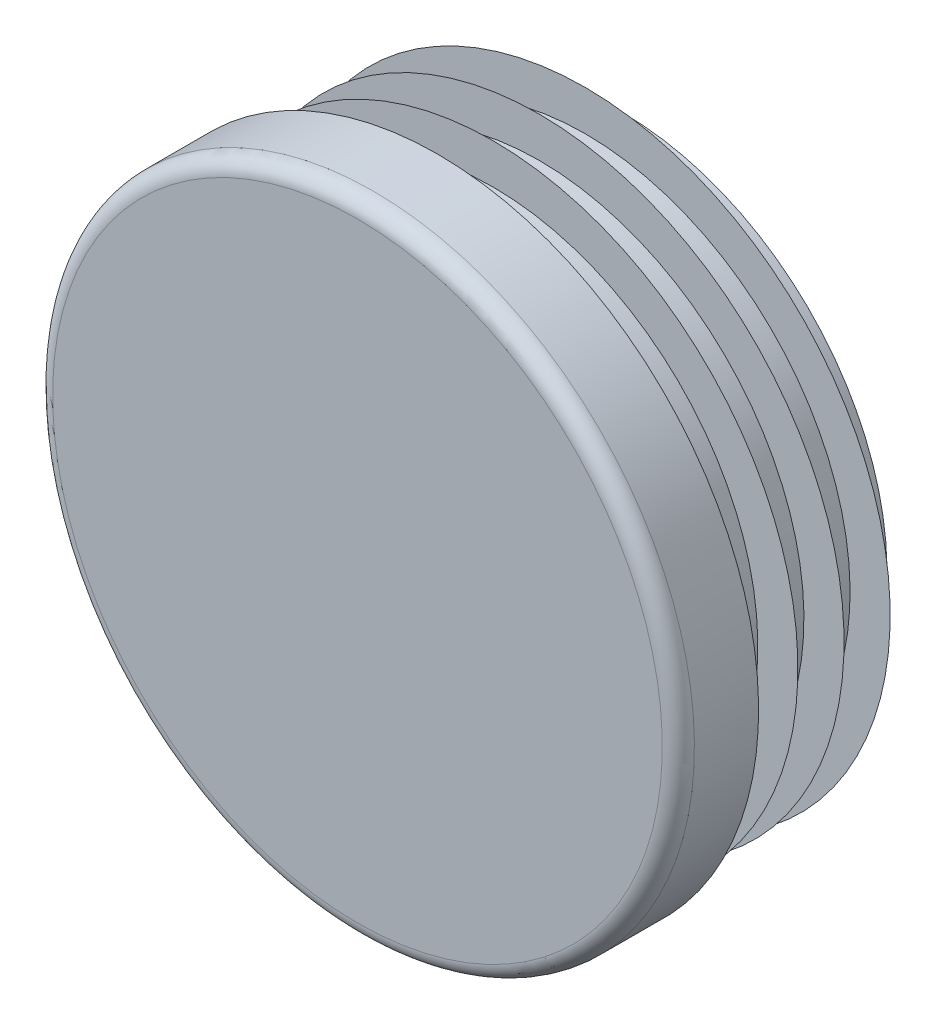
ISO-10303-21;
HEADER;
FILE_DESCRIPTION(('STEP AP214'),'2;1');
FILE_NAME('part.step','',(''),(''),'','','');
FILE_SCHEMA(('AUTOMOTIVE_DESIGN { 1 0 10303 214 1 1 1 1 }'));
ENDSEC;
DATA;
#1=APPLICATION_CONTEXT('core data for automotive mechanical design processes');
#2=APPLICATION_PROTOCOL_DEFINITION('international standard','automotive_design',2000,#1);
#3=PRODUCT_CONTEXT('',#1,'mechanical');
#4=PRODUCT('Part','Part','',(#3));
#5=PRODUCT_RELATED_PRODUCT_CATEGORY('part','',(#4));
#6=PRODUCT_DEFINITION_FORMATION('','',#4);
#7=PRODUCT_DEFINITION_CONTEXT('part definition',#1,'design');
#8=PRODUCT_DEFINITION('design','',#6,#7);
#9=PRODUCT_DEFINITION_SHAPE('','',#8);
#10=(LENGTH_UNIT() NAMED_UNIT(*) SI_UNIT(.MILLI.,.METRE.));
#11=(NAMED_UNIT(*) PLANE_ANGLE_UNIT() SI_UNIT($,.RADIAN.));
#12=(NAMED_UNIT(*) SI_UNIT($,.STERADIAN.) SOLID_ANGLE_UNIT());
#13=UNCERTAINTY_MEASURE_WITH_UNIT(LENGTH_MEASURE(1.E-05),#10,'distance_accuracy_value','');
#14=(GEOMETRIC_REPRESENTATION_CONTEXT(3) GLOBAL_UNCERTAINTY_ASSIGNED_CONTEXT((#13)) GLOBAL_UNIT_ASSIGNED_CONTEXT((#10,
#11,#12)) REPRESENTATION_CONTEXT('',''));
#15=CARTESIAN_POINT('',(0.,0.,0.));
#16=DIRECTION('',(0.,0.,1.));
#17=DIRECTION('',(1.,0.,0.));
#18=AXIS2_PLACEMENT_3D('',#15,#16,#17);
#19=CARTESIAN_POINT('',(0.,0.,5.));
#20=DIRECTION('',(0.,0.,-1.));
#21=DIRECTION('',(0.,1.,0.));
#22=AXIS2_PLACEMENT_3D('',#19,#20,#21);
#23=PLANE('',#22);
#24=CARTESIAN_POINT('',(0.,0.,5.));
#25=DIRECTION('',(0.,0.,-1.));
#26=DIRECTION('',(0.,1.,0.));
#27=AXIS2_PLACEMENT_3D('',#24,#25,#26);
#28=CIRCLE('',#27,19.);
#29=CARTESIAN_POINT('',(0.,19.,5.));
#30=VERTEX_POINT('',#29);
#31=EDGE_CURVE('E8',#30,#30,#28,.T.);
#32=ORIENTED_EDGE('',*,*,#31,.F.);
#33=EDGE_LOOP('',(#32));
#34=FACE_BOUND('',#33,.T.);
#35=ADVANCED_FACE('F12',(#34),#23,.F.);
#36=CARTESIAN_POINT('',(0.,0.,4.));
#37=DIRECTION('',(0.,0.,-1.));
#38=DIRECTION('',(0.,1.,0.));
#39=AXIS2_PLACEMENT_3D('',#36,#37,#38);
#40=TOROIDAL_SURFACE('',#39,19.,1.);
#41=ORIENTED_EDGE('',*,*,#31,.T.);
#42=EDGE_LOOP('',(#41));
#43=FACE_BOUND('',#42,.T.);
#44=CARTESIAN_POINT('',(0.,0.,4.));
#45=DIRECTION('',(0.,0.,-1.));
#46=DIRECTION('',(0.,1.,0.));
#47=AXIS2_PLACEMENT_3D('',#44,#45,#46);
#48=CIRCLE('',#47,20.);
#49=CARTESIAN_POINT('',(0.,20.,4.));
#50=VERTEX_POINT('',#49);
#51=EDGE_CURVE('E18',#50,#50,#48,.T.);
#52=ORIENTED_EDGE('',*,*,#51,.F.);
#53=EDGE_LOOP('',(#52));
#54=FACE_BOUND('',#53,.T.);
#55=ADVANCED_FACE('F159',(#43,#54),#40,.T.);
#56=CARTESIAN_POINT('',(0.,0.,-11.5));
#57=DIRECTION('',(0.,0.,-1.));
#58=DIRECTION('',(0.,1.,0.));
#59=AXIS2_PLACEMENT_3D('',#56,#57,#58);
#60=CYLINDRICAL_SURFACE('',#59,20.);
#61=CARTESIAN_POINT('',(0.,0.,0.));
#62=DIRECTION('',(0.,0.,-1.));
#63=DIRECTION('',(0.,1.,0.));
#64=AXIS2_PLACEMENT_3D('',#61,#62,#63);
#65=CIRCLE('',#64,20.);
#66=CARTESIAN_POINT('',(0.,20.,0.));
#67=VERTEX_POINT('',#66);
#68=EDGE_CURVE('E22',#67,#67,#65,.T.);
#69=ORIENTED_EDGE('',*,*,#68,.F.);
#70=EDGE_LOOP('',(#69));
#71=FACE_BOUND('',#70,.T.);
#72=ORIENTED_EDGE('',*,*,#51,.T.);
#73=EDGE_LOOP('',(#72));
#74=FACE_BOUND('',#73,.T.);
#75=ADVANCED_FACE('F154',(#71,#74),#60,.T.);
#76=CARTESIAN_POINT('',(20.,0.,0.));
#77=DIRECTION('',(0.,0.,1.));
#78=DIRECTION('',(0.,-1.,0.));
#79=AXIS2_PLACEMENT_3D('',#76,#77,#78);
#80=PLANE('',#79);
#81=CARTESIAN_POINT('',(0.,0.,0.));
#82=DIRECTION('',(0.,0.,-1.));
#83=DIRECTION('',(0.,1.,0.));
#84=AXIS2_PLACEMENT_3D('',#81,#82,#83);
#85=CIRCLE('',#84,16.5);
#86=CARTESIAN_POINT('',(0.,16.5,0.));
#87=VERTEX_POINT('',#86);
#88=EDGE_CURVE('E26',#87,#87,#85,.T.);
#89=ORIENTED_EDGE('',*,*,#88,.F.);
#90=EDGE_LOOP('',(#89));
#91=FACE_BOUND('',#90,.T.);
#92=ORIENTED_EDGE('',*,*,#68,.T.);
#93=EDGE_LOOP('',(#92));
#94=FACE_BOUND('',#93,.T.);
#95=ADVANCED_FACE('F148',(#91,#94),#80,.F.);
#96=CARTESIAN_POINT('',(0.,0.,-11.5));
#97=DIRECTION('',(0.,0.,-1.));
#98=DIRECTION('',(0.,1.,0.));
#99=AXIS2_PLACEMENT_3D('',#96,#97,#98);
#100=CYLINDRICAL_SURFACE('',#99,16.5);
#101=CARTESIAN_POINT('',(0.,0.,-0.575));
#102=DIRECTION('',(0.,0.,-1.));
#103=DIRECTION('',(0.,1.,0.));
#104=AXIS2_PLACEMENT_3D('',#101,#102,#103);
#105=CIRCLE('',#104,16.5);
#106=CARTESIAN_POINT('',(0.,16.5,-0.575));
#107=VERTEX_POINT('',#106);
#108=EDGE_CURVE('E31',#107,#107,#105,.T.);
#109=ORIENTED_EDGE('',*,*,#108,.F.);
#110=EDGE_LOOP('',(#109));
#111=FACE_BOUND('',#110,.T.);
#112=ORIENTED_EDGE('',*,*,#88,.T.);
#113=EDGE_LOOP('',(#112));
#114=FACE_BOUND('',#113,.T.);
#115=ADVANCED_FACE('F142',(#111,#114),#100,.T.);
#116=CARTESIAN_POINT('',(16.5,0.,-0.575));
#117=DIRECTION('',(0.,0.,-1.));
#118=DIRECTION('',(0.,1.,0.));
#119=AXIS2_PLACEMENT_3D('',#116,#117,#118);
#120=PLANE('',#119);
#121=CARTESIAN_POINT('',(0.,0.,-0.575));
#122=DIRECTION('',(0.,0.,-1.));
#123=DIRECTION('',(0.,1.,0.));
#124=AXIS2_PLACEMENT_3D('',#121,#122,#123);
#125=CIRCLE('',#124,19.);
#126=CARTESIAN_POINT('',(0.,19.,-0.575));
#127=VERTEX_POINT('',#126);
#128=EDGE_CURVE('E34',#127,#127,#125,.T.);
#129=ORIENTED_EDGE('',*,*,#128,.F.);
#130=EDGE_LOOP('',(#129));
#131=FACE_BOUND('',#130,.T.);
#132=ORIENTED_EDGE('',*,*,#108,.T.);
#133=EDGE_LOOP('',(#132));
#134=FACE_BOUND('',#133,.T.);
#135=ADVANCED_FACE('F136',(#131,#134),#120,.F.);
#136=CARTESIAN_POINT('',(0.,0.,-0.575));
#137=DIRECTION('',(0.,0.,1.));
#138=DIRECTION('',(0.,-1.,0.));
#139=AXIS2_PLACEMENT_3D('',#136,#137,#138);
#140=CONICAL_SURFACE('',#139,19.,0.959931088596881);
#141=CARTESIAN_POINT('',(0.,0.,-2.32551884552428));
#142=DIRECTION('',(0.,0.,-1.));
#143=DIRECTION('',(0.,1.,0.));
#144=AXIS2_PLACEMENT_3D('',#141,#142,#143);
#145=CIRCLE('',#144,16.5);
#146=CARTESIAN_POINT('',(0.,16.5,-2.32551884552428));
#147=VERTEX_POINT('',#146);
#148=EDGE_CURVE('E37',#147,#147,#145,.T.);
#149=ORIENTED_EDGE('',*,*,#148,.F.);
#150=EDGE_LOOP('',(#149));
#151=FACE_BOUND('',#150,.T.);
#152=ORIENTED_EDGE('',*,*,#128,.T.);
#153=EDGE_LOOP('',(#152));
#154=FACE_BOUND('',#153,.T.);
#155=ADVANCED_FACE('F130',(#151,#154),#140,.T.);
#156=CARTESIAN_POINT('',(0.,0.,-11.5));
#157=DIRECTION('',(0.,0.,-1.));
#158=DIRECTION('',(0.,1.,0.));
#159=AXIS2_PLACEMENT_3D('',#156,#157,#158);
#160=CYLINDRICAL_SURFACE('',#159,16.5);
#161=CARTESIAN_POINT('',(0.,0.,-3.45));
#162=DIRECTION('',(0.,0.,-1.));
#163=DIRECTION('',(0.,1.,0.));
#164=AXIS2_PLACEMENT_3D('',#161,#162,#163);
#165=CIRCLE('',#164,16.5);
#166=CARTESIAN_POINT('',(0.,16.5,-3.45));
#167=VERTEX_POINT('',#166);
#168=EDGE_CURVE('E40',#167,#167,#165,.T.);
#169=ORIENTED_EDGE('',*,*,#168,.F.);
#170=EDGE_LOOP('',(#169));
#171=FACE_BOUND('',#170,.T.);
#172=ORIENTED_EDGE('',*,*,#148,.T.);
#173=EDGE_LOOP('',(#172));
#174=FACE_BOUND('',#173,.T.);
#175=ADVANCED_FACE('F124',(#171,#174),#160,.T.);
#176=CARTESIAN_POINT('',(16.5,0.,-3.45));
#177=DIRECTION('',(0.,0.,-1.));
#178=DIRECTION('',(0.,1.,0.));
#179=AXIS2_PLACEMENT_3D('',#176,#177,#178);
#180=PLANE('',#179);
#181=CARTESIAN_POINT('',(0.,0.,-3.45));
#182=DIRECTION('',(0.,0.,-1.));
#183=DIRECTION('',(0.,1.,0.));
#184=AXIS2_PLACEMENT_3D('',#181,#182,#183);
#185=CIRCLE('',#184,19.);
#186=CARTESIAN_POINT('',(0.,19.,-3.45));
#187=VERTEX_POINT('',#186);
#188=EDGE_CURVE('E43',#187,#187,#185,.T.);
#189=ORIENTED_EDGE('',*,*,#188,.F.);
#190=EDGE_LOOP('',(#189));
#191=FACE_BOUND('',#190,.T.);
#192=ORIENTED_EDGE('',*,*,#168,.T.);
#193=EDGE_LOOP('',(#192));
#194=FACE_BOUND('',#193,.T.);
#195=ADVANCED_FACE('F118',(#191,#194),#180,.F.);
#196=CARTESIAN_POINT('',(0.,0.,-3.45));
#197=DIRECTION('',(0.,0.,1.));
#198=DIRECTION('',(0.,-1.,0.));
#199=AXIS2_PLACEMENT_3D('',#196,#197,#198);
#200=CONICAL_SURFACE('',#199,19.,0.959931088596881);
#201=CARTESIAN_POINT('',(0.,0.,-5.20051884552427));
#202=DIRECTION('',(0.,0.,-1.));
#203=DIRECTION('',(0.,1.,0.));
#204=AXIS2_PLACEMENT_3D('',#201,#202,#203);
#205=CIRCLE('',#204,16.5);
#206=CARTESIAN_POINT('',(0.,16.5,-5.20051884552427));
#207=VERTEX_POINT('',#206);
#208=EDGE_CURVE('E46',#207,#207,#205,.T.);
#209=ORIENTED_EDGE('',*,*,#208,.F.);
#210=EDGE_LOOP('',(#209));
#211=FACE_BOUND('',#210,.T.);
#212=ORIENTED_EDGE('',*,*,#188,.T.);
#213=EDGE_LOOP('',(#212));
#214=FACE_BOUND('',#213,.T.);
#215=ADVANCED_FACE('F112',(#211,#214),#200,.T.);
#216=CARTESIAN_POINT('',(0.,0.,-11.5));
#217=DIRECTION('',(0.,0.,-1.));
#218=DIRECTION('',(0.,1.,0.));
#219=AXIS2_PLACEMENT_3D('',#216,#217,#218);
#220=CYLINDRICAL_SURFACE('',#219,16.5);
#221=CARTESIAN_POINT('',(0.,0.,-6.325));
#222=DIRECTION('',(0.,0.,-1.));
#223=DIRECTION('',(0.,1.,0.));
#224=AXIS2_PLACEMENT_3D('',#221,#222,#223);
#225=CIRCLE('',#224,16.5);
#226=CARTESIAN_POINT('',(0.,16.5,-6.325));
#227=VERTEX_POINT('',#226);
#228=EDGE_CURVE('E49',#227,#227,#225,.T.);
#229=ORIENTED_EDGE('',*,*,#228,.F.);
#230=EDGE_LOOP('',(#229));
#231=FACE_BOUND('',#230,.T.);
#232=ORIENTED_EDGE('',*,*,#208,.T.);
#233=EDGE_LOOP('',(#232));
#234=FACE_BOUND('',#233,.T.);
#235=ADVANCED_FACE('F106',(#231,#234),#220,.T.);
#236=CARTESIAN_POINT('',(16.5,0.,-6.325));
#237=DIRECTION('',(0.,0.,-1.));
#238=DIRECTION('',(0.,1.,0.));
#239=AXIS2_PLACEMENT_3D('',#236,#237,#238);
#240=PLANE('',#239);
#241=CARTESIAN_POINT('',(0.,0.,-6.325));
#242=DIRECTION('',(0.,0.,-1.));
#243=DIRECTION('',(0.,1.,0.));
#244=AXIS2_PLACEMENT_3D('',#241,#242,#243);
#245=CIRCLE('',#244,19.);
#246=CARTESIAN_POINT('',(0.,19.,-6.325));
#247=VERTEX_POINT('',#246);
#248=EDGE_CURVE('E52',#247,#247,#245,.T.);
#249=ORIENTED_EDGE('',*,*,#248,.F.);
#250=EDGE_LOOP('',(#249));
#251=FACE_BOUND('',#250,.T.);
#252=ORIENTED_EDGE('',*,*,#228,.T.);
#253=EDGE_LOOP('',(#252));
#254=FACE_BOUND('',#253,.T.);
#255=ADVANCED_FACE('F100',(#251,#254),#240,.F.);
#256=CARTESIAN_POINT('',(0.,0.,-6.325));
#257=DIRECTION('',(0.,0.,1.));
#258=DIRECTION('',(0.,-1.,0.));
#259=AXIS2_PLACEMENT_3D('',#256,#257,#258);
#260=CONICAL_SURFACE('',#259,19.,0.95993108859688);
#261=CARTESIAN_POINT('',(0.,0.,-8.07551884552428));
#262=DIRECTION('',(0.,0.,-1.));
#263=DIRECTION('',(0.,1.,0.));
#264=AXIS2_PLACEMENT_3D('',#261,#262,#263);
#265=CIRCLE('',#264,16.5);
#266=CARTESIAN_POINT('',(0.,16.5,-8.07551884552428));
#267=VERTEX_POINT('',#266);
#268=EDGE_CURVE('E55',#267,#267,#265,.T.);
#269=ORIENTED_EDGE('',*,*,#268,.F.);
#270=EDGE_LOOP('',(#269));
#271=FACE_BOUND('',#270,.T.);
#272=ORIENTED_EDGE('',*,*,#248,.T.);
#273=EDGE_LOOP('',(#272));
#274=FACE_BOUND('',#273,.T.);
#275=ADVANCED_FACE('F94',(#271,#274),#260,.T.);
#276=CARTESIAN_POINT('',(0.,0.,-11.5));
#277=DIRECTION('',(0.,0.,-1.));
#278=DIRECTION('',(0.,1.,0.));
#279=AXIS2_PLACEMENT_3D('',#276,#277,#278);
#280=CYLINDRICAL_SURFACE('',#279,16.5);
#281=CARTESIAN_POINT('',(0.,0.,-9.2));
#282=DIRECTION('',(0.,0.,-1.));
#283=DIRECTION('',(0.,1.,0.));
#284=AXIS2_PLACEMENT_3D('',#281,#282,#283);
#285=CIRCLE('',#284,16.5);
#286=CARTESIAN_POINT('',(0.,16.5,-9.2));
#287=VERTEX_POINT('',#286);
#288=EDGE_CURVE('E58',#287,#287,#285,.T.);
#289=ORIENTED_EDGE('',*,*,#288,.F.);
#290=EDGE_LOOP('',(#289));
#291=FACE_BOUND('',#290,.T.);
#292=ORIENTED_EDGE('',*,*,#268,.T.);
#293=EDGE_LOOP('',(#292));
#294=FACE_BOUND('',#293,.T.);
#295=ADVANCED_FACE('F88',(#291,#294),#280,.T.);
#296=CARTESIAN_POINT('',(16.5,0.,-9.2));
#297=DIRECTION('',(0.,0.,-1.));
#298=DIRECTION('',(0.,1.,0.));
#299=AXIS2_PLACEMENT_3D('',#296,#297,#298);
#300=PLANE('',#299);
#301=CARTESIAN_POINT('',(0.,0.,-9.2));
#302=DIRECTION('',(0.,0.,-1.));
#303=DIRECTION('',(0.,1.,0.));
#304=AXIS2_PLACEMENT_3D('',#301,#302,#303);
#305=CIRCLE('',#304,19.);
#306=CARTESIAN_POINT('',(0.,19.,-9.2));
#307=VERTEX_POINT('',#306);
#308=EDGE_CURVE('E61',#307,#307,#305,.T.);
#309=ORIENTED_EDGE('',*,*,#308,.F.);
#310=EDGE_LOOP('',(#309));
#311=FACE_BOUND('',#310,.T.);
#312=ORIENTED_EDGE('',*,*,#288,.T.);
#313=EDGE_LOOP('',(#312));
#314=FACE_BOUND('',#313,.T.);
#315=ADVANCED_FACE('F82',(#311,#314),#300,.F.);
#316=CARTESIAN_POINT('',(0.,0.,-9.2));
#317=DIRECTION('',(0.,0.,1.));
#318=DIRECTION('',(0.,-1.,0.));
#319=AXIS2_PLACEMENT_3D('',#316,#317,#318);
#320=CONICAL_SURFACE('',#319,19.,0.959931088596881);
#321=CARTESIAN_POINT('',(0.,0.,-10.9505188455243));
#322=DIRECTION('',(0.,0.,-1.));
#323=DIRECTION('',(0.,1.,0.));
#324=AXIS2_PLACEMENT_3D('',#321,#322,#323);
#325=CIRCLE('',#324,16.5);
#326=CARTESIAN_POINT('',(0.,16.5,-10.9505188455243));
#327=VERTEX_POINT('',#326);
#328=EDGE_CURVE('E64',#327,#327,#325,.T.);
#329=ORIENTED_EDGE('',*,*,#328,.F.);
#330=EDGE_LOOP('',(#329));
#331=FACE_BOUND('',#330,.T.);
#332=ORIENTED_EDGE('',*,*,#308,.T.);
#333=EDGE_LOOP('',(#332));
#334=FACE_BOUND('',#333,.T.);
#335=ADVANCED_FACE('F76',(#331,#334),#320,.T.);
#336=CARTESIAN_POINT('',(0.,0.,-11.5));
#337=DIRECTION('',(0.,0.,-1.));
#338=DIRECTION('',(0.,1.,0.));
#339=AXIS2_PLACEMENT_3D('',#336,#337,#338);
#340=CYLINDRICAL_SURFACE('',#339,16.5);
#341=CARTESIAN_POINT('',(0.,0.,-11.5));
#342=DIRECTION('',(0.,0.,-1.));
#343=DIRECTION('',(0.,1.,0.));
#344=AXIS2_PLACEMENT_3D('',#341,#342,#343);
#345=CIRCLE('',#344,16.5);
#346=CARTESIAN_POINT('',(0.,16.5,-11.5));
#347=VERTEX_POINT('',#346);
#348=EDGE_CURVE('E67',#347,#347,#345,.T.);
#349=ORIENTED_EDGE('',*,*,#348,.F.);
#350=EDGE_LOOP('',(#349));
#351=FACE_BOUND('',#350,.T.);
#352=ORIENTED_EDGE('',*,*,#328,.T.);
#353=EDGE_LOOP('',(#352));
#354=FACE_BOUND('',#353,.T.);
#355=ADVANCED_FACE('F73',(#351,#354),#340,.T.);
#356=CARTESIAN_POINT('',(16.5,0.,-11.5));
#357=DIRECTION('',(0.,0.,1.));
#358=DIRECTION('',(0.,-1.,0.));
#359=AXIS2_PLACEMENT_3D('',#356,#357,#358);
#360=PLANE('',#359);
#361=ORIENTED_EDGE('',*,*,#348,.T.);
#362=EDGE_LOOP('',(#361));
#363=FACE_BOUND('',#362,.T.);
#364=ADVANCED_FACE('F71',(#363),#360,.F.);
#365=CLOSED_SHELL('',(#35,#55,#75,#95,#115,#135,#155,#175,#195,#215,#235,#255,#275,#295,#315,
#335,#355,#364));
#366=MANIFOLD_SOLID_BREP('B1',#365);
#367=ADVANCED_BREP_SHAPE_REPRESENTATION('',(#18,#366),#14);
#368=SHAPE_DEFINITION_REPRESENTATION(#9,#367);
ENDSEC;
END-ISO-10303-21;
